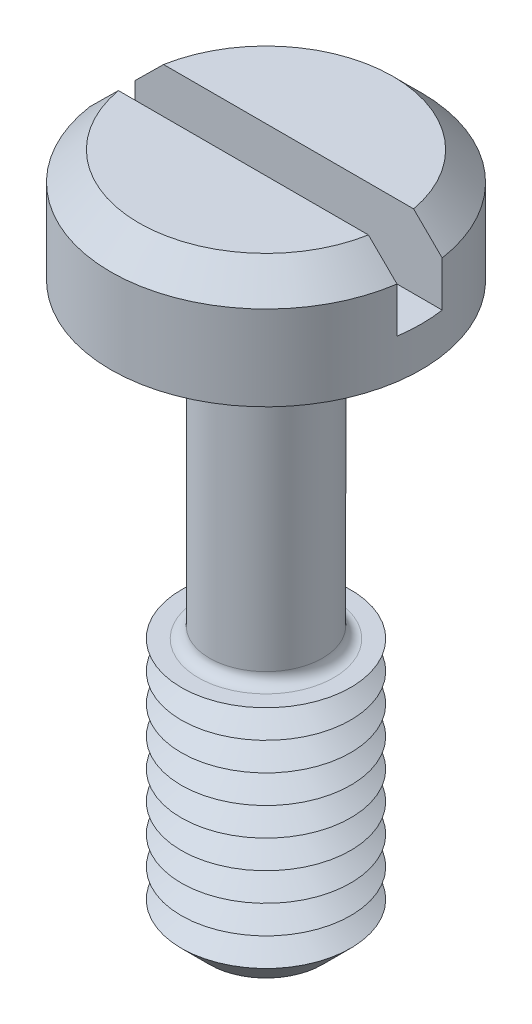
from build123d import *

# Parameters (mm, degrees)
SKETCH1_R           = 2.75
BOSS_EXTRUDE1_DEPTH = 2
SKETCH2_R           = 1
BOSS_EXTRUDE2_DEPTH = 10
SKETCH3_R           = 1.5
BOSS_EXTRUDE3_DEPTH = 4.5
CHAMFER1_SIZE       = 0.5
LPATTERN1_COUNT     = 8
LPATTERN1_PITCH     = 0.5
FILLET1_R           = 0.2
CHAMFER2_SIZE       = 0.5
SKETCH6_W           = 5.5
SKETCH6_H           = 0.8
CUT_EXTRUDE1_DEPTH  = 1.3


with BuildPart() as part:
    # Sketch1 → Boss-Extrude1 (new body)
    with BuildSketch(Plane(origin=(0, 0, 0), x_dir=(1, 0, 0), z_dir=(0, 1, 0))):
        with Locations(Location((0, 0, 0), (0, 0, 270))):
            Circle(SKETCH1_R)
    extrude(amount=BOSS_EXTRUDE1_DEPTH)

    # Sketch2 → Boss-Extrude2 (add)
    with BuildSketch(Plane.XZ):
        with Locations(Location((0, 0, 0), (0, 0, 270))):
            Circle(SKETCH2_R)
    extrude(amount=BOSS_EXTRUDE2_DEPTH)

    # Sketch3 → Boss-Extrude3 (add)
    with BuildSketch(Plane.XZ.offset(10)):
        with Locations(Location((0, 0, 0), (0, 0, 270))):
            Circle(SKETCH3_R)
    extrude(amount=-BOSS_EXTRUDE3_DEPTH)

    # Chamfer1
    chamfer1_edges = [part.edges().sort_by_distance(p)[0] for p in [
        (0, -10, 1.5),
    ]]
    chamfer(chamfer1_edges, length=CHAMFER1_SIZE)

    # Sketch5 → Cut-Revolve1 (revolve, cut)
    with BuildSketch(Plane(origin=(0, 0, 0), x_dir=(0, 0, -1), z_dir=(1, 0, 0))):
        Polygon((-1.5, -5.5), (-1.066987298, -5.75), (-1.5, -6), align=None)
    cut_revolve1 = revolve(axis=Axis((0, -6.58711856, 0), (0, -1, 0)), mode=Mode.SUBTRACT)

    # LPattern1: Cut-Revolve1 ×8
    with Locations(*[(0, -i * LPATTERN1_PITCH, 0) for i in range(1, LPATTERN1_COUNT)]):
        add(cut_revolve1, mode=Mode.SUBTRACT)

    # Fillet1
    fillet1_edges = [part.edges().sort_by_distance(p)[0] for p in [
        (0, 0, 1),
        (0, -5.5, 1),
    ]]
    fillet(fillet1_edges, radius=FILLET1_R)

    # Chamfer2
    chamfer2_edges = [part.edges().sort_by_distance(p)[0] for p in [
        (0, 2, -2.75),
    ]]
    chamfer(chamfer2_edges, length=CHAMFER2_SIZE)

    # Sketch6 → Cut-Extrude1 (cut)
    with BuildSketch(Plane(origin=(0, 2, 0), x_dir=(1, 0, 0), z_dir=(0, 1, 0))):
        Rectangle(SKETCH6_W, SKETCH6_H)
    extrude(amount=-CUT_EXTRUDE1_DEPTH, mode=Mode.SUBTRACT)


solid = part.part
